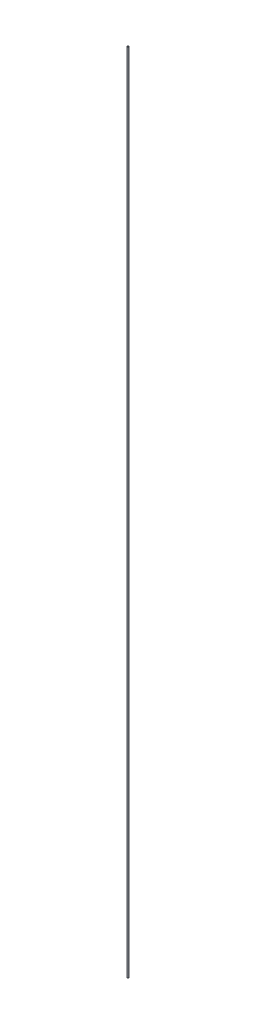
ISO-10303-21;
HEADER;
FILE_DESCRIPTION(('STEP AP214'),'2;1');
FILE_NAME('part.step','',(''),(''),'','','');
FILE_SCHEMA(('AUTOMOTIVE_DESIGN { 1 0 10303 214 1 1 1 1 }'));
ENDSEC;
DATA;
#1=APPLICATION_CONTEXT('core data for automotive mechanical design processes');
#2=APPLICATION_PROTOCOL_DEFINITION('international standard','automotive_design',2000,#1);
#3=PRODUCT_CONTEXT('',#1,'mechanical');
#4=PRODUCT('Part','Part','',(#3));
#5=PRODUCT_RELATED_PRODUCT_CATEGORY('part','',(#4));
#6=PRODUCT_DEFINITION_FORMATION('','',#4);
#7=PRODUCT_DEFINITION_CONTEXT('part definition',#1,'design');
#8=PRODUCT_DEFINITION('design','',#6,#7);
#9=PRODUCT_DEFINITION_SHAPE('','',#8);
#10=(LENGTH_UNIT() NAMED_UNIT(*) SI_UNIT(.MILLI.,.METRE.));
#11=(NAMED_UNIT(*) PLANE_ANGLE_UNIT() SI_UNIT($,.RADIAN.));
#12=(NAMED_UNIT(*) SI_UNIT($,.STERADIAN.) SOLID_ANGLE_UNIT());
#13=UNCERTAINTY_MEASURE_WITH_UNIT(LENGTH_MEASURE(1.E-05),#10,'distance_accuracy_value','');
#14=(GEOMETRIC_REPRESENTATION_CONTEXT(3) GLOBAL_UNCERTAINTY_ASSIGNED_CONTEXT((#13)) GLOBAL_UNIT_ASSIGNED_CONTEXT((#10,
#11,#12)) REPRESENTATION_CONTEXT('',''));
#15=CARTESIAN_POINT('',(0.,0.,0.));
#16=DIRECTION('',(0.,0.,1.));
#17=DIRECTION('',(1.,0.,0.));
#18=AXIS2_PLACEMENT_3D('',#15,#16,#17);
#19=CARTESIAN_POINT('',(0.,1680.,0.));
#20=DIRECTION('',(0.,-1.,0.));
#21=DIRECTION('',(0.,0.,-1.));
#22=AXIS2_PLACEMENT_3D('',#19,#20,#21);
#23=CYLINDRICAL_SURFACE('',#22,1.5);
#24=CARTESIAN_POINT('',(0.,1680.,0.));
#25=DIRECTION('',(0.,1.,0.));
#26=DIRECTION('',(0.,0.,1.));
#27=AXIS2_PLACEMENT_3D('',#24,#25,#26);
#28=CIRCLE('',#27,1.5);
#29=CARTESIAN_POINT('',(0.,1680.,1.5));
#30=VERTEX_POINT('',#29);
#31=EDGE_CURVE('E10',#30,#30,#28,.T.);
#32=ORIENTED_EDGE('',*,*,#31,.F.);
#33=EDGE_LOOP('',(#32));
#34=FACE_BOUND('',#33,.T.);
#35=CARTESIAN_POINT('',(0.,0.,0.));
#36=DIRECTION('',(0.,1.,0.));
#37=DIRECTION('',(0.,0.,1.));
#38=AXIS2_PLACEMENT_3D('',#35,#36,#37);
#39=CIRCLE('',#38,1.5);
#40=CARTESIAN_POINT('',(0.,0.,1.5));
#41=VERTEX_POINT('',#40);
#42=EDGE_CURVE('E33',#41,#41,#39,.T.);
#43=ORIENTED_EDGE('',*,*,#42,.T.);
#44=EDGE_LOOP('',(#43));
#45=FACE_BOUND('',#44,.T.);
#46=ADVANCED_FACE('F30',(#34,#45),#23,.T.);
#47=CARTESIAN_POINT('',(0.,1680.,0.));
#48=DIRECTION('',(0.,1.,0.));
#49=DIRECTION('',(0.,0.,1.));
#50=AXIS2_PLACEMENT_3D('',#47,#48,#49);
#51=PLANE('',#50);
#52=ORIENTED_EDGE('',*,*,#31,.T.);
#53=EDGE_LOOP('',(#52));
#54=FACE_BOUND('',#53,.T.);
#55=ADVANCED_FACE('F45',(#54),#51,.T.);
#56=CARTESIAN_POINT('',(0.,0.,0.));
#57=DIRECTION('',(0.,1.,0.));
#58=DIRECTION('',(0.,0.,1.));
#59=AXIS2_PLACEMENT_3D('',#56,#57,#58);
#60=PLANE('',#59);
#61=ORIENTED_EDGE('',*,*,#42,.F.);
#62=EDGE_LOOP('',(#61));
#63=FACE_BOUND('',#62,.T.);
#64=ADVANCED_FACE('F43',(#63),#60,.F.);
#65=CLOSED_SHELL('',(#46,#55,#64));
#66=MANIFOLD_SOLID_BREP('B2',#65);
#67=ADVANCED_BREP_SHAPE_REPRESENTATION('',(#18,#66),#14);
#68=SHAPE_DEFINITION_REPRESENTATION(#9,#67);
ENDSEC;
END-ISO-10303-21;
